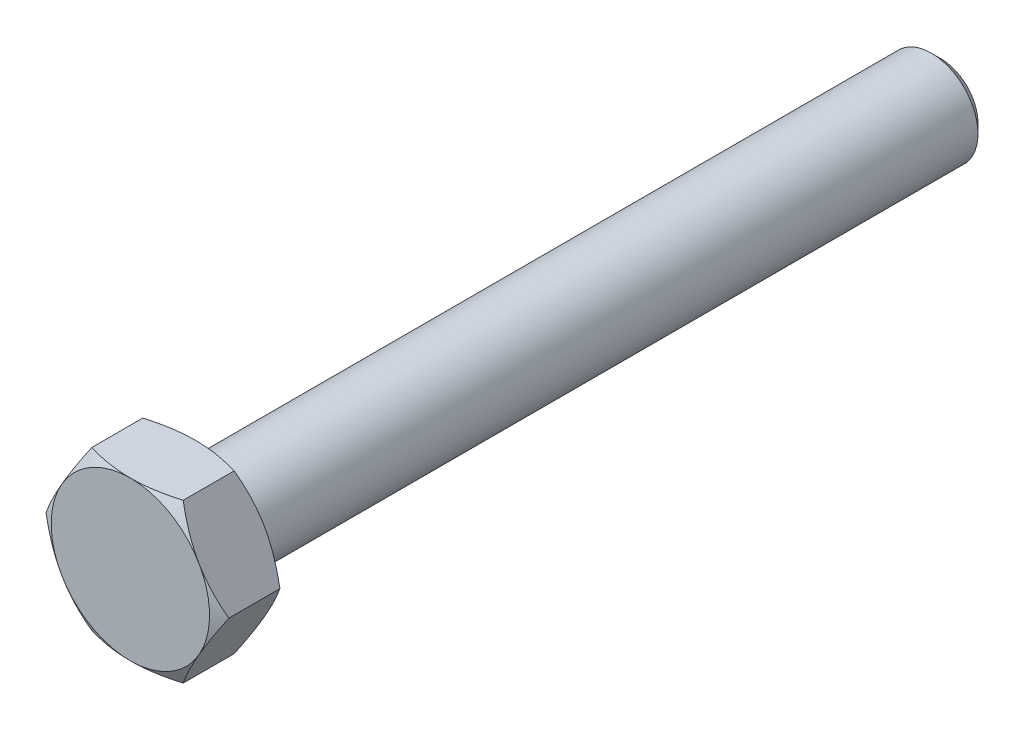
from build123d import *

# Parameters (mm, degrees)
BASE_EXTRUSION_DEPTH    = 7
ESQUISSE2_R             = 15
ESQUISSE2_R_2           = 8.5
ENL_V_MAT_EXTRU_1_DEPTH = 5
ENL_V_MAT_EXTRU_1_DRAFT = -60
ESQUISSE3_R             = 15
ESQUISSE3_R_2           = 8.5
ENL_V_MAT_EXTRU_2_DEPTH = 5
ENL_V_MAT_EXTRU_2_DRAFT = -60
ESQUISSE4_R             = 5
BOSS_EXTRU_1_DEPTH      = 80
CHANFREIN1_SIZE         = 1


with BuildPart() as part:
    # Esquisse1 → Base-Extrusion (new body)
    with BuildSketch(Plane.XY):
        Polygon((-4.907477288, -8.5), (-9.814954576, 0), (-4.907477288, 8.5), (4.907477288, 8.5), (9.814954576, 0), (4.907477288, -8.5), align=None)
    extrude(amount=BASE_EXTRUSION_DEPTH)


with BuildPart() as enl_v_mat_extru_1_tool:
    # Esquisse2 → Enl_v. mat.-Extru.1 (with draft: the straight prism first)
    with BuildSketch(Plane(origin=(0, 0, 0), x_dir=(-1, 0, 0), z_dir=(0, 0, -1))):
        Circle(ESQUISSE2_R)
        Circle(ESQUISSE2_R_2, mode=Mode.SUBTRACT)
    extrude(amount=-ENL_V_MAT_EXTRU_1_DEPTH)
    # Enl_v. mat.-Extru.1: the draft: its side faces are tilted about the plane it starts from
    enl_v_mat_extru_1_sides = [enl_v_mat_extru_1_tool.faces().sort_by_distance(p)[0] for p in [
        (15, 0, 2.5),
        (8.5, 0, 2.5),
    ]]
    draft(enl_v_mat_extru_1_sides, Plane(origin=(0, 0, 0), x_dir=(-1, 0, 0), z_dir=(0, 0, -1)), ENL_V_MAT_EXTRU_1_DRAFT)


with BuildPart() as part_1:
    add(part.part)

    # Enl_v. mat.-Extru.1: cut by enl_v_mat_extru_1_tool
    add(enl_v_mat_extru_1_tool.part, mode=Mode.SUBTRACT)


with BuildPart() as enl_v_mat_extru_2_tool:
    # Esquisse3 → Enl_v. mat.-Extru.2 (with draft: the straight prism first)
    with BuildSketch(Plane.XY.offset(7)):
        Circle(ESQUISSE3_R)
        Circle(ESQUISSE3_R_2, mode=Mode.SUBTRACT)
    extrude(amount=-ENL_V_MAT_EXTRU_2_DEPTH)
    # Enl_v. mat.-Extru.2: the draft: its side faces are tilted about the plane it starts from
    enl_v_mat_extru_2_sides = [enl_v_mat_extru_2_tool.faces().sort_by_distance(p)[0] for p in [
        (-15, 0, 4.5),
        (-8.5, 0, 4.5),
    ]]
    draft(enl_v_mat_extru_2_sides, Plane.XY.offset(7), ENL_V_MAT_EXTRU_2_DRAFT)


with BuildPart() as part_2:
    add(part_1.part)

    # Enl_v. mat.-Extru.2: cut by enl_v_mat_extru_2_tool
    add(enl_v_mat_extru_2_tool.part, mode=Mode.SUBTRACT)

    # Esquisse4 → Boss.-Extru.1 (add)
    with BuildSketch(Plane(origin=(0, 0, 0), x_dir=(-1, 0, 0), z_dir=(0, 0, -1))):
        with Locations(Location((0, 0, 0), (0, 0, 180))):
            Circle(ESQUISSE4_R)
    extrude(amount=BOSS_EXTRU_1_DEPTH)

    # Chanfrein1
    chanfrein1_edges = [part_2.edges().sort_by_distance(p)[0] for p in [
        (-5, 0, -80),
    ]]
    chamfer(chanfrein1_edges, length=CHANFREIN1_SIZE)


solid = part_2.part
